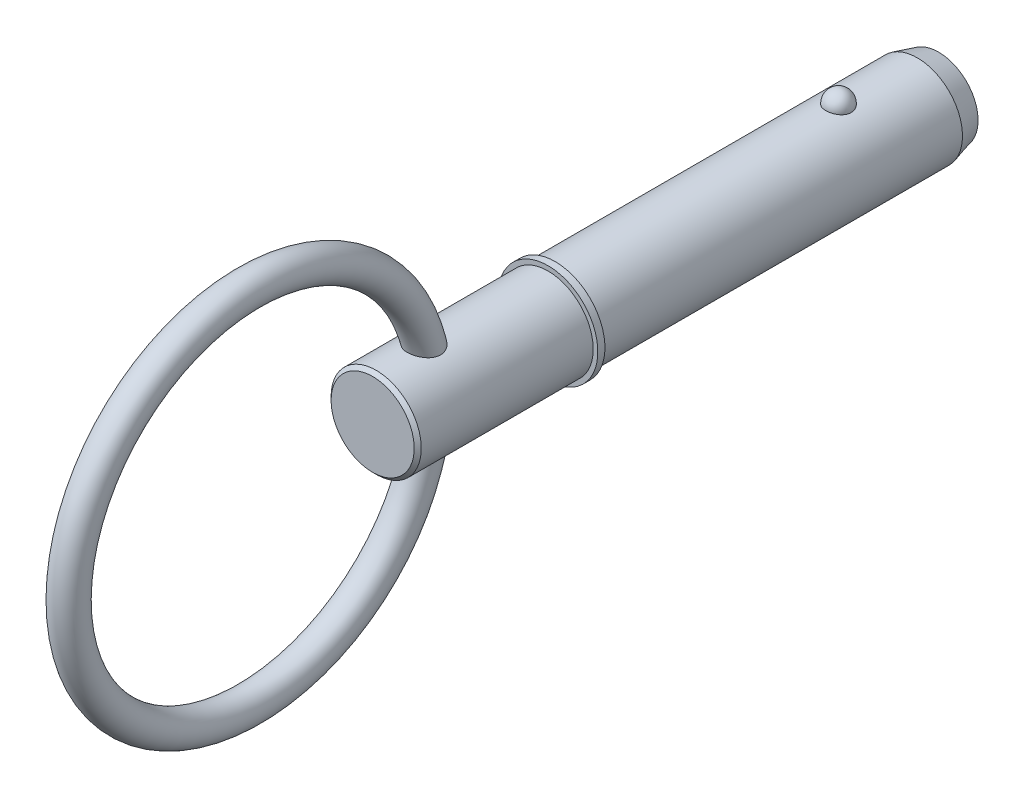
ISO-10303-21;
HEADER;
FILE_DESCRIPTION(('STEP AP214'),'2;1');
FILE_NAME('part.step','',(''),(''),'','','');
FILE_SCHEMA(('AUTOMOTIVE_DESIGN { 1 0 10303 214 1 1 1 1 }'));
ENDSEC;
DATA;
#1=APPLICATION_CONTEXT('core data for automotive mechanical design processes');
#2=APPLICATION_PROTOCOL_DEFINITION('international standard','automotive_design',2000,#1);
#3=PRODUCT_CONTEXT('',#1,'mechanical');
#4=PRODUCT('Part','Part','',(#3));
#5=PRODUCT_RELATED_PRODUCT_CATEGORY('part','',(#4));
#6=PRODUCT_DEFINITION_FORMATION('','',#4);
#7=PRODUCT_DEFINITION_CONTEXT('part definition',#1,'design');
#8=PRODUCT_DEFINITION('design','',#6,#7);
#9=PRODUCT_DEFINITION_SHAPE('','',#8);
#10=(LENGTH_UNIT() NAMED_UNIT(*) SI_UNIT(.MILLI.,.METRE.));
#11=(NAMED_UNIT(*) PLANE_ANGLE_UNIT() SI_UNIT($,.RADIAN.));
#12=(NAMED_UNIT(*) SI_UNIT($,.STERADIAN.) SOLID_ANGLE_UNIT());
#13=UNCERTAINTY_MEASURE_WITH_UNIT(LENGTH_MEASURE(1.E-05),#10,'distance_accuracy_value','');
#14=(GEOMETRIC_REPRESENTATION_CONTEXT(3) GLOBAL_UNCERTAINTY_ASSIGNED_CONTEXT((#13)) GLOBAL_UNIT_ASSIGNED_CONTEXT((#10,
#11,#12)) REPRESENTATION_CONTEXT('',''));
#15=CARTESIAN_POINT('',(0.,0.,0.));
#16=DIRECTION('',(0.,0.,1.));
#17=DIRECTION('',(1.,0.,0.));
#18=AXIS2_PLACEMENT_3D('',#15,#16,#17);
#19=CARTESIAN_POINT('',(0.,0.,38.1));
#20=DIRECTION('',(0.,0.,-1.));
#21=DIRECTION('',(-1.,0.,0.));
#22=AXIS2_PLACEMENT_3D('',#19,#20,#21);
#23=CYLINDRICAL_SURFACE('',#22,6.35);
#24=CARTESIAN_POINT('',(1.76243001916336,6.10051968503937,-1.78));
#25=CARTESIAN_POINT('',(1.76242835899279,6.10052111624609,-1.68050311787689));
#26=CARTESIAN_POINT('',(1.75431593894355,6.1028816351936,-1.58098521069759));
#27=CARTESIAN_POINT('',(1.72206027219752,6.11206037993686,-1.38476972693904));
#28=CARTESIAN_POINT('',(1.69791106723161,6.11888026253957,-1.28807321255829));
#29=CARTESIAN_POINT('',(1.63419596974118,6.13620287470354,-1.10029899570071));
#30=CARTESIAN_POINT('',(1.59463684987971,6.14670398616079,-1.00921884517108));
#31=CARTESIAN_POINT('',(1.50108569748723,6.17021534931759,-0.835161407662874));
#32=CARTESIAN_POINT('',(1.44709398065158,6.18322554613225,-0.752183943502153));
#33=CARTESIAN_POINT('',(1.3257243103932,6.21038081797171,-0.596209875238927));
#34=CARTESIAN_POINT('',(1.2582815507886,6.22453118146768,-0.523264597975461));
#35=CARTESIAN_POINT('',(1.11191624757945,6.25233390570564,-0.389855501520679));
#36=CARTESIAN_POINT('',(1.03299369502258,6.26598626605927,-0.329391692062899));
#37=CARTESIAN_POINT('',(0.866022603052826,6.29123226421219,-0.222793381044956));
#38=CARTESIAN_POINT('',(0.77800091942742,6.30283170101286,-0.176618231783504));
#39=CARTESIAN_POINT('',(0.595108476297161,6.32272058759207,-0.0996905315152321));
#40=CARTESIAN_POINT('',(0.500238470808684,6.33101040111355,-0.0689362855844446));
#41=CARTESIAN_POINT('',(0.308164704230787,6.34323464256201,-0.0241595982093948));
#42=CARTESIAN_POINT('',(0.211033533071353,6.34724467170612,-0.00984637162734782));
#43=CARTESIAN_POINT('',(0.0156629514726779,6.3507318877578,0.00262058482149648));
#44=CARTESIAN_POINT('',(-0.0825763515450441,6.35020951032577,0.000775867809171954));
#45=CARTESIAN_POINT('',(-0.275890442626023,6.34473055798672,-0.0188727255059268));
#46=CARTESIAN_POINT('',(-0.370990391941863,6.3398374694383,-0.0364481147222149));
#47=CARTESIAN_POINT('',(-0.556805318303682,6.32622723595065,-0.0867447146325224));
#48=CARTESIAN_POINT('',(-0.64752021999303,6.31751002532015,-0.119466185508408));
#49=CARTESIAN_POINT('',(-0.82260655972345,6.29711353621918,-0.199386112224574));
#50=CARTESIAN_POINT('',(-0.906938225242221,6.28541739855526,-0.246667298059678));
#51=CARTESIAN_POINT('',(-1.06646479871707,6.26032612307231,-0.35436574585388));
#52=CARTESIAN_POINT('',(-1.14165877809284,6.24693081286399,-0.414784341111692));
#53=CARTESIAN_POINT('',(-1.2823514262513,6.21959142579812,-0.548435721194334));
#54=CARTESIAN_POINT('',(-1.34763761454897,6.2056417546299,-0.621891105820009));
#55=CARTESIAN_POINT('',(-1.4651153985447,6.1789624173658,-0.778815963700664));
#56=CARTESIAN_POINT('',(-1.51730606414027,6.16623283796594,-0.862286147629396));
#57=CARTESIAN_POINT('',(-1.60782211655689,6.14325839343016,-1.0379915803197));
#58=CARTESIAN_POINT('',(-1.64598111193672,6.13304379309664,-1.13031660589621));
#59=CARTESIAN_POINT('',(-1.70661885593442,6.11644899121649,-1.32030667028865));
#60=CARTESIAN_POINT('',(-1.72909805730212,6.11006867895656,-1.41797155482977));
#61=CARTESIAN_POINT('',(-1.75775019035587,6.1018881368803,-1.61543246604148));
#62=CARTESIAN_POINT('',(-1.76399136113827,6.10006874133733,-1.71521779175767));
#63=CARTESIAN_POINT('',(-1.76020715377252,6.10116172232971,-1.91445126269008));
#64=CARTESIAN_POINT('',(-1.75018221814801,6.10407397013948,-2.01389941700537));
#65=CARTESIAN_POINT('',(-1.71421005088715,6.11427232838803,-2.20912106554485));
#66=CARTESIAN_POINT('',(-1.68834262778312,6.12153651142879,-2.30491043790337));
#67=CARTESIAN_POINT('',(-1.62139543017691,6.1396067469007,-2.49066180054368));
#68=CARTESIAN_POINT('',(-1.5803150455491,6.15041294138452,-2.58062355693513));
#69=CARTESIAN_POINT('',(-1.48369112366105,6.17443456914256,-2.75271428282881));
#70=CARTESIAN_POINT('',(-1.42806998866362,6.18766281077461,-2.83479789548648));
#71=CARTESIAN_POINT('',(-1.30386620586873,6.21501934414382,-2.98832532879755));
#72=CARTESIAN_POINT('',(-1.23528306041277,6.22914767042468,-3.05976874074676));
#73=CARTESIAN_POINT('',(-1.08663999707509,6.25679135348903,-3.19029656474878));
#74=CARTESIAN_POINT('',(-1.00653826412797,6.27030422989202,-3.24933392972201));
#75=CARTESIAN_POINT('',(-0.837212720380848,6.29514770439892,-3.35304657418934));
#76=CARTESIAN_POINT('',(-0.747989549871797,6.30647845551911,-3.39772286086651));
#77=CARTESIAN_POINT('',(-0.564098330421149,6.32556124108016,-3.47096393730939));
#78=CARTESIAN_POINT('',(-0.469512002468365,6.33335611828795,-3.49972259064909));
#79=CARTESIAN_POINT('',(-0.276633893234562,6.34470628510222,-3.54113722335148));
#80=CARTESIAN_POINT('',(-0.178342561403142,6.34826208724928,-3.55379514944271));
#81=CARTESIAN_POINT('',(0.0171660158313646,6.35071525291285,-3.56255473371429));
#82=CARTESIAN_POINT('',(0.114368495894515,6.34969931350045,-3.55896450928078));
#83=CARTESIAN_POINT('',(0.306746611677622,6.34331695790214,-3.53603383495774));
#84=CARTESIAN_POINT('',(0.401922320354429,6.33795069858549,-3.51669395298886));
#85=CARTESIAN_POINT('',(0.58720370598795,6.32347219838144,-3.4629173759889));
#86=CARTESIAN_POINT('',(0.677327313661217,6.31437430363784,-3.42853846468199));
#87=CARTESIAN_POINT('',(0.850462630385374,6.29339543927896,-3.34564128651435));
#88=CARTESIAN_POINT('',(0.933473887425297,6.2815142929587,-3.29712212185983));
#89=CARTESIAN_POINT('',(1.09144542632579,6.25601750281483,-3.18638742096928));
#90=CARTESIAN_POINT('',(1.16626195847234,6.24237795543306,-3.12397237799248));
#91=CARTESIAN_POINT('',(1.30444862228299,6.21497285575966,-2.98755865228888));
#92=CARTESIAN_POINT('',(1.36781676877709,6.20120728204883,-2.91355796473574));
#93=CARTESIAN_POINT('',(1.48252779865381,6.17479923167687,-2.75456133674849));
#94=CARTESIAN_POINT('',(1.53364167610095,6.16218052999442,-2.66939613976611));
#95=CARTESIAN_POINT('',(1.62109397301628,6.13975602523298,-2.49147502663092));
#96=CARTESIAN_POINT('',(1.657437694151,6.12994921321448,-2.39872184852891));
#97=CARTESIAN_POINT('',(1.71127844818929,6.11512175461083,-2.21887622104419));
#98=CARTESIAN_POINT('',(1.73042646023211,6.10968903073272,-2.13230770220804));
#99=CARTESIAN_POINT('',(1.75600284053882,6.10238739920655,-1.95716498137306));
#100=CARTESIAN_POINT('',(1.76243149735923,6.10051841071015,-1.86859082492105));
#101=CARTESIAN_POINT('',(1.76243001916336,6.10051968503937,-1.78));
#102=B_SPLINE_CURVE_WITH_KNOTS('',3,(#24,#25,#26,#27,#28,#29,#30,#31,#32,#33,#34,#35,#36,#37,
#38,#39,#40,#41,#42,#43,#44,#45,#46,#47,#48,#49,#50,#51,#52,#53,#54,#55,#56,#57,#58,#59,#60,#61,
#62,#63,#64,#65,#66,#67,#68,#69,#70,#71,#72,#73,#74,#75,#76,#77,#78,#79,#80,#81,#82,#83,#84,#85,
#86,#87,#88,#89,#90,#91,#92,#93,#94,#95,#96,#97,#98,#99,#100,#101),.UNSPECIFIED.,.T.,.F.,(4,2,2,
2,2,2,2,2,2,2,2,2,2,2,2,2,2,2,2,2,2,2,2,2,2,2,2,2,2,2,2,2,2,2,2,2,2,2,4),(0.,0.298172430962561,
0.596455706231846,0.894608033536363,1.19275383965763,1.49237238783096,1.79199116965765,
2.09074960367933,2.38947519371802,2.68283180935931,2.97616022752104,3.26529599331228,
3.55443672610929,3.84525169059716,4.13609618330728,4.43249276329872,4.72891038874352,
5.02873757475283,5.32855610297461,5.62711261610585,5.92566100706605,6.22271765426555,
6.51978621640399,6.81847366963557,7.11717259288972,7.41698459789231,7.71677557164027,
8.01283014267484,8.30884891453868,8.59927798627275,8.88969658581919,9.17900899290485,
9.46833977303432,9.76212836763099,10.0559678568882,10.3549321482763,10.6537890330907,
10.9192841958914,11.1847733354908),.UNSPECIFIED.);
#103=CARTESIAN_POINT('',(1.76243001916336,6.10051968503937,-1.78));
#104=VERTEX_POINT('',#103);
#105=EDGE_CURVE('E101',#104,#104,#102,.T.);
#106=ORIENTED_EDGE('',*,*,#105,.T.);
#107=EDGE_LOOP('',(#106));
#108=FACE_BOUND('',#107,.T.);
#109=CARTESIAN_POINT('',(0.,0.,-12.8800000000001));
#110=DIRECTION('',(0.,0.,-1.));
#111=DIRECTION('',(-1.,0.,0.));
#112=AXIS2_PLACEMENT_3D('',#109,#110,#111);
#113=CIRCLE('',#112,6.35);
#114=CARTESIAN_POINT('',(-6.35,0.,-12.8800000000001));
#115=VERTEX_POINT('',#114);
#116=EDGE_CURVE('E108',#115,#115,#113,.F.);
#117=ORIENTED_EDGE('',*,*,#116,.T.);
#118=EDGE_LOOP('',(#117));
#119=FACE_BOUND('',#118,.T.);
#120=CARTESIAN_POINT('',(0.,0.,38.1));
#121=DIRECTION('',(0.,0.,1.));
#122=DIRECTION('',(1.,0.,0.));
#123=AXIS2_PLACEMENT_3D('',#120,#121,#122);
#124=CIRCLE('',#123,6.35);
#125=CARTESIAN_POINT('',(6.35,0.,38.1));
#126=VERTEX_POINT('',#125);
#127=EDGE_CURVE('E106',#126,#126,#124,.T.);
#128=ORIENTED_EDGE('',*,*,#127,.F.);
#129=EDGE_LOOP('',(#128));
#130=FACE_BOUND('',#129,.T.);
#131=ADVANCED_FACE('F39',(#108,#119,#130),#23,.T.);
#132=CARTESIAN_POINT('',(0.,0.,-15.88));
#133=DIRECTION('',(0.,0.,-1.));
#134=DIRECTION('',(-1.,0.,0.));
#135=AXIS2_PLACEMENT_3D('',#132,#133,#134);
#136=PLANE('',#135);
#137=CARTESIAN_POINT('',(0.,0.,-15.88));
#138=DIRECTION('',(0.,0.,-1.));
#139=DIRECTION('',(-1.,0.,0.));
#140=AXIS2_PLACEMENT_3D('',#137,#138,#139);
#141=CIRCLE('',#140,5.54615242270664);
#142=CARTESIAN_POINT('',(-5.54615242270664,0.,-15.88));
#143=VERTEX_POINT('',#142);
#144=EDGE_CURVE('E142',#143,#143,#141,.T.);
#145=ORIENTED_EDGE('',*,*,#144,.T.);
#146=EDGE_LOOP('',(#145));
#147=FACE_BOUND('',#146,.T.);
#148=ADVANCED_FACE('F87',(#147),#136,.T.);
#149=CARTESIAN_POINT('',(0.,0.,-15.88));
#150=DIRECTION('',(0.,0.,1.));
#151=DIRECTION('',(1.,0.,0.));
#152=AXIS2_PLACEMENT_3D('',#149,#150,#151);
#153=CONICAL_SURFACE('',#152,5.54615242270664,0.26179938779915);
#154=ORIENTED_EDGE('',*,*,#116,.F.);
#155=EDGE_LOOP('',(#154));
#156=FACE_BOUND('',#155,.T.);
#157=ORIENTED_EDGE('',*,*,#144,.F.);
#158=EDGE_LOOP('',(#157));
#159=FACE_BOUND('',#158,.T.);
#160=ADVANCED_FACE('F93',(#156,#159),#153,.T.);
#161=CARTESIAN_POINT('',(0.,6.35,-1.78));
#162=DIRECTION('',(0.,1.,0.));
#163=DIRECTION('',(0.,0.,1.));
#164=AXIS2_PLACEMENT_3D('',#161,#162,#163);
#165=SPHERICAL_SURFACE('',#164,1.78);
#166=ORIENTED_EDGE('',*,*,#105,.F.);
#167=EDGE_LOOP('',(#166));
#168=FACE_BOUND('',#167,.T.);
#169=ADVANCED_FACE('F111',(#168),#165,.T.);
#170=CARTESIAN_POINT('',(0.,0.,38.1));
#171=DIRECTION('',(0.,0.,-1.));
#172=DIRECTION('',(-1.,0.,0.));
#173=AXIS2_PLACEMENT_3D('',#170,#171,#172);
#174=PLANE('',#173);
#175=ORIENTED_EDGE('',*,*,#127,.T.);
#176=EDGE_LOOP('',(#175));
#177=FACE_BOUND('',#176,.T.);
#178=CARTESIAN_POINT('',(0.,0.,38.1));
#179=DIRECTION('',(0.,0.,-1.));
#180=DIRECTION('',(-1.,0.,0.));
#181=AXIS2_PLACEMENT_3D('',#178,#179,#180);
#182=CIRCLE('',#181,7.);
#183=CARTESIAN_POINT('',(-7.,0.,38.1));
#184=VERTEX_POINT('',#183);
#185=EDGE_CURVE('E107',#184,#184,#182,.T.);
#186=ORIENTED_EDGE('',*,*,#185,.T.);
#187=EDGE_LOOP('',(#186));
#188=FACE_BOUND('',#187,.T.);
#189=ADVANCED_FACE('F115',(#177,#188),#174,.T.);
#190=CARTESIAN_POINT('',(0.,0.,33.7287874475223));
#191=DIRECTION('',(0.,0.,-1.));
#192=DIRECTION('',(-1.,0.,0.));
#193=AXIS2_PLACEMENT_3D('',#190,#191,#192);
#194=CYLINDRICAL_SURFACE('',#193,7.);
#195=CARTESIAN_POINT('',(0.,0.,39.1));
#196=DIRECTION('',(0.,0.,-1.));
#197=DIRECTION('',(-1.,0.,0.));
#198=AXIS2_PLACEMENT_3D('',#195,#196,#197);
#199=CIRCLE('',#198,7.);
#200=CARTESIAN_POINT('',(-7.,0.,39.1));
#201=VERTEX_POINT('',#200);
#202=EDGE_CURVE('E132',#201,#201,#199,.T.);
#203=ORIENTED_EDGE('',*,*,#202,.T.);
#204=EDGE_LOOP('',(#203));
#205=FACE_BOUND('',#204,.T.);
#206=ORIENTED_EDGE('',*,*,#185,.F.);
#207=EDGE_LOOP('',(#206));
#208=FACE_BOUND('',#207,.T.);
#209=ADVANCED_FACE('F119',(#205,#208),#194,.T.);
#210=CARTESIAN_POINT('',(0.,7.,39.1));
#211=DIRECTION('',(0.,0.,1.));
#212=DIRECTION('',(1.,0.,0.));
#213=AXIS2_PLACEMENT_3D('',#210,#211,#212);
#214=PLANE('',#213);
#215=CARTESIAN_POINT('',(0.,0.,39.1));
#216=DIRECTION('',(0.,0.,1.));
#217=DIRECTION('',(1.,0.,0.));
#218=AXIS2_PLACEMENT_3D('',#215,#216,#217);
#219=CIRCLE('',#218,6.35);
#220=CARTESIAN_POINT('',(6.35,0.,39.1));
#221=VERTEX_POINT('',#220);
#222=EDGE_CURVE('E110',#221,#221,#219,.T.);
#223=ORIENTED_EDGE('',*,*,#222,.F.);
#224=EDGE_LOOP('',(#223));
#225=FACE_BOUND('',#224,.T.);
#226=ORIENTED_EDGE('',*,*,#202,.F.);
#227=EDGE_LOOP('',(#226));
#228=FACE_BOUND('',#227,.T.);
#229=ADVANCED_FACE('F84',(#225,#228),#214,.T.);
#230=CARTESIAN_POINT('',(0.,0.,63.8));
#231=DIRECTION('',(0.,0.,-1.));
#232=DIRECTION('',(-1.,0.,0.));
#233=AXIS2_PLACEMENT_3D('',#230,#231,#232);
#234=CYLINDRICAL_SURFACE('',#233,6.35);
#235=CARTESIAN_POINT('',(-1.08120660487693,-6.25727514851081,54.5515811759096));
#236=CARTESIAN_POINT('',(-0.97072437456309,-6.27636409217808,54.4938798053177));
#237=CARTESIAN_POINT('',(-0.855136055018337,-6.29329984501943,54.4452195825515));
#238=CARTESIAN_POINT('',(-0.616958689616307,-6.32109419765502,54.3670559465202));
#239=CARTESIAN_POINT('',(-0.494369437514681,-6.3319526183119,54.3375530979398));
#240=CARTESIAN_POINT('',(-0.245606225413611,-6.34647141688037,54.2983673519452));
#241=CARTESIAN_POINT('',(-0.119431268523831,-6.35012977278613,54.2886900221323));
#242=CARTESIAN_POINT('',(0.132849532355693,-6.34986313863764,54.2894002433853));
#243=CARTESIAN_POINT('',(0.2589553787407,-6.34593843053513,54.2997870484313));
#244=CARTESIAN_POINT('',(0.506912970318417,-6.33094785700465,54.3402854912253));
#245=CARTESIAN_POINT('',(0.628781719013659,-6.31991516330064,54.3703055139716));
#246=CARTESIAN_POINT('',(0.865486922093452,-6.29187143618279,54.4493088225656));
#247=CARTESIAN_POINT('',(0.980322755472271,-6.27485987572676,54.498293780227));
#248=CARTESIAN_POINT('',(1.20050616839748,-6.23649440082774,54.6145408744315));
#249=CARTESIAN_POINT('',(1.30578867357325,-6.21511352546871,54.6819174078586));
#250=CARTESIAN_POINT('',(1.50311440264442,-6.17036440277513,54.8333596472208));
#251=CARTESIAN_POINT('',(1.59515714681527,-6.14699608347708,54.9174259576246));
#252=CARTESIAN_POINT('',(1.76326863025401,-6.10090072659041,55.1002474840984));
#253=CARTESIAN_POINT('',(1.83935482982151,-6.07817301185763,55.1989864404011));
#254=CARTESIAN_POINT('',(1.97338559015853,-6.03599268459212,55.408703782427));
#255=CARTESIAN_POINT('',(2.03133638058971,-6.01653894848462,55.5196779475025));
#256=CARTESIAN_POINT('',(2.1259120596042,-5.98376466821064,55.747018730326));
#257=CARTESIAN_POINT('',(2.16315310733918,-5.97026970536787,55.8631040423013));
#258=CARTESIAN_POINT('',(2.21830650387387,-5.94999923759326,56.1003187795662));
#259=CARTESIAN_POINT('',(2.2362211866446,-5.94322292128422,56.2214475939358));
#260=CARTESIAN_POINT('',(2.25273772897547,-5.93698111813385,56.4632812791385));
#261=CARTESIAN_POINT('',(2.25163224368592,-5.93740484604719,56.5839640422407));
#262=CARTESIAN_POINT('',(2.23167546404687,-5.94493297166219,56.8236203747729));
#263=CARTESIAN_POINT('',(2.21281883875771,-5.9520393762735,56.9425934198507));
#264=CARTESIAN_POINT('',(2.15679576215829,-5.97257680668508,57.183836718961));
#265=CARTESIAN_POINT('',(2.11851138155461,-5.98639144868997,57.3058128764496));
#266=CARTESIAN_POINT('',(2.02470263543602,-6.01876484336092,57.5422848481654));
#267=CARTESIAN_POINT('',(1.96916879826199,-6.03732620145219,57.6567765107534));
#268=CARTESIAN_POINT('',(1.8352662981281,-6.07945247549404,57.8879958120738));
#269=CARTESIAN_POINT('',(1.75507038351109,-6.10334207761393,58.0036110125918));
#270=CARTESIAN_POINT('',(1.57657889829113,-6.1518655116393,58.2198949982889));
#271=CARTESIAN_POINT('',(1.47827192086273,-6.17649980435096,58.3205542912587));
#272=CARTESIAN_POINT('',(1.26306696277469,-6.22410762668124,58.5050235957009));
#273=CARTESIAN_POINT('',(1.14585214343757,-6.24704086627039,58.5884783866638));
#274=CARTESIAN_POINT('',(0.896825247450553,-6.28760987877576,58.731400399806));
#275=CARTESIAN_POINT('',(0.765036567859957,-6.30525397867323,58.7909053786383));
#276=CARTESIAN_POINT('',(0.509454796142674,-6.330648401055,58.8752631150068));
#277=CARTESIAN_POINT('',(0.38696423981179,-6.33940909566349,58.9036959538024));
#278=CARTESIAN_POINT('',(0.200813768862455,-6.3471308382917,58.9286800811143));
#279=CARTESIAN_POINT('',(0.138353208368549,-6.34880140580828,58.934063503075));
#280=CARTESIAN_POINT('',(0.0131841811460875,-6.35029448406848,58.9388738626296));
#281=CARTESIAN_POINT('',(-0.049524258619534,-6.35011719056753,58.9383014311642));
#282=CARTESIAN_POINT('',(-0.219860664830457,-6.34710452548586,58.9285979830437));
#283=CARTESIAN_POINT('',(-0.32717637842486,-6.34243953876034,58.9135767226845));
#284=CARTESIAN_POINT('',(-0.537619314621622,-6.32808248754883,58.866673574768));
#285=CARTESIAN_POINT('',(-0.640746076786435,-6.31838987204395,58.8347898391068));
#286=CARTESIAN_POINT('',(-0.84179516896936,-6.29478075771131,58.7553379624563));
#287=CARTESIAN_POINT('',(-0.939631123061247,-6.28081033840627,58.70756888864));
#288=CARTESIAN_POINT('',(-1.1269056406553,-6.2499288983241,58.5985138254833));
#289=CARTESIAN_POINT('',(-1.21634109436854,-6.23301679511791,58.537222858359));
#290=CARTESIAN_POINT('',(-1.3971303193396,-6.19517308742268,58.3940397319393));
#291=CARTESIAN_POINT('',(-1.48711596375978,-6.17400700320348,58.3104839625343));
#292=CARTESIAN_POINT('',(-1.65373642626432,-6.13148145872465,58.130996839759));
#293=CARTESIAN_POINT('',(-1.73036130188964,-6.11012186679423,58.0350563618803));
#294=CARTESIAN_POINT('',(-1.87908981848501,-6.06616529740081,57.8186208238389));
#295=CARTESIAN_POINT('',(-1.94902044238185,-6.04382072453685,57.6965721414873));
#296=CARTESIAN_POINT('',(-2.06849605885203,-6.00398244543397,57.4420700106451));
#297=CARTESIAN_POINT('',(-2.11803457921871,-5.98649027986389,57.3096132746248));
#298=CARTESIAN_POINT('',(-2.19551930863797,-5.95851933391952,57.0345936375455));
#299=CARTESIAN_POINT('',(-2.22297667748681,-5.94819998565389,56.8918743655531));
#300=CARTESIAN_POINT('',(-2.25222139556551,-5.93719450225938,56.6034800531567));
#301=CARTESIAN_POINT('',(-2.25403508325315,-5.93649848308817,56.4578081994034));
#302=CARTESIAN_POINT('',(-2.23178480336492,-5.94489150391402,56.1838044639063));
#303=CARTESIAN_POINT('',(-2.21035650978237,-5.95298402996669,56.0552268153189));
#304=CARTESIAN_POINT('',(-2.14565882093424,-5.97660650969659,55.8044089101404));
#305=CARTESIAN_POINT('',(-2.10239634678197,-5.99213410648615,55.6821666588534));
#306=CARTESIAN_POINT('',(-1.99913159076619,-6.02732890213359,55.4567478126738));
#307=CARTESIAN_POINT('',(-1.94060271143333,-6.04660536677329,55.3528298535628));
#308=CARTESIAN_POINT('',(-1.80736340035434,-6.08775699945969,55.156534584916));
#309=CARTESIAN_POINT('',(-1.73265259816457,-6.10963222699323,55.0641575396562));
#310=CARTESIAN_POINT('',(-1.56865095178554,-6.15378470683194,54.8926034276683));
#311=CARTESIAN_POINT('',(-1.47928749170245,-6.17606344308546,54.8134962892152));
#312=CARTESIAN_POINT('',(-1.28858731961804,-6.21864788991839,54.6706753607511));
#313=CARTESIAN_POINT('',(-1.18724893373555,-6.23895332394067,54.6069637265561));
#314=CARTESIAN_POINT('',(-1.08120660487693,-6.25727514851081,54.5515811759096));
#315=B_SPLINE_CURVE_WITH_KNOTS('',3,(#235,#236,#237,#238,#239,#240,#241,#242,#243,#244,#245,
#246,#247,#248,#249,#250,#251,#252,#253,#254,#255,#256,#257,#258,#259,#260,#261,#262,#263,#264,
#265,#266,#267,#268,#269,#270,#271,#272,#273,#274,#275,#276,#277,#278,#279,#280,#281,#282,#283,
#284,#285,#286,#287,#288,#289,#290,#291,#292,#293,#294,#295,#296,#297,#298,#299,#300,#301,#302,
#303,#304,#305,#306,#307,#308,#309,#310,#311,#312,#313,#314),.UNSPECIFIED.,.T.,.F.,(4,2,2,2,2,2,
2,2,2,2,2,2,2,2,2,2,2,2,2,2,2,2,2,2,2,2,2,2,2,2,2,2,2,2,2,2,2,2,2,4),(0.,0.377861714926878,
0.755734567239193,1.13371352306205,1.51167842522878,1.88789208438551,2.26413891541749,
2.64278156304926,3.02143792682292,3.39967776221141,3.77778752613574,4.14394628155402,
4.51006081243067,4.87054720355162,5.23114188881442,5.61534494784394,5.99975934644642,
6.42600522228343,6.85252048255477,7.28711365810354,7.72101899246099,8.09666132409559,
8.28452949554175,8.47237776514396,8.79607953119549,9.11981678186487,9.44781545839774,
9.77593508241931,10.1483085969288,10.5209580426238,10.9463240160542,11.3718248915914,
11.8065046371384,12.2407378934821,12.6304236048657,13.0199858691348,13.3807583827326,
13.7415391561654,14.104165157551,14.4668419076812),.UNSPECIFIED.);
#316=CARTESIAN_POINT('',(-1.08120660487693,-6.25727514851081,54.5515811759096));
#317=VERTEX_POINT('',#316);
#318=EDGE_CURVE('E10',#317,#317,#315,.T.);
#319=ORIENTED_EDGE('',*,*,#318,.F.);
#320=EDGE_LOOP('',(#319));
#321=FACE_BOUND('',#320,.T.);
#322=CARTESIAN_POINT('',(-1.08120660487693,6.25727514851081,54.5515811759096));
#323=CARTESIAN_POINT('',(-1.1909316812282,6.23831652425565,54.608887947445));
#324=CARTESIAN_POINT('',(-1.295627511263,6.21723224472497,54.6751167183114));
#325=CARTESIAN_POINT('',(-1.49211272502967,6.17302620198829,54.824020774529));
#326=CARTESIAN_POINT('',(-1.58390200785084,6.14990442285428,54.9066961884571));
#327=CARTESIAN_POINT('',(-1.7520969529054,6.10411985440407,55.0867778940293));
#328=CARTESIAN_POINT('',(-1.82848346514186,6.08145766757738,55.1842022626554));
#329=CARTESIAN_POINT('',(-1.96346259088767,6.0392331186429,55.3912733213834));
#330=CARTESIAN_POINT('',(-2.02206050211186,6.01966983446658,55.5009163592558));
#331=CARTESIAN_POINT('',(-2.11860444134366,5.9863659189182,55.7265649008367));
#332=CARTESIAN_POINT('',(-2.15701637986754,5.97249571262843,55.8423519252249));
#333=CARTESIAN_POINT('',(-2.2144930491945,5.95142584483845,56.0791911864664));
#334=CARTESIAN_POINT('',(-2.23356015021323,5.94422536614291,56.2002427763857));
#335=CARTESIAN_POINT('',(-2.25228141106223,5.93715610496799,56.4419445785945));
#336=CARTESIAN_POINT('',(-2.25225786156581,5.93716560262,56.5625670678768));
#337=CARTESIAN_POINT('',(-2.2344206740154,5.94389982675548,56.8022777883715));
#338=CARTESIAN_POINT('',(-2.21660184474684,5.95062651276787,56.9213655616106));
#339=CARTESIAN_POINT('',(-2.16272689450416,5.97042554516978,57.1627056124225));
#340=CARTESIAN_POINT('',(-2.12559286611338,5.98387086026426,57.2846848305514));
#341=CARTESIAN_POINT('',(-2.03409944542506,6.0155857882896,57.521342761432));
#342=CARTESIAN_POINT('',(-1.97973080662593,6.03385799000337,57.6360175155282));
#343=CARTESIAN_POINT('',(-1.84828023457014,6.07549301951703,57.8678654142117));
#344=CARTESIAN_POINT('',(-1.76936622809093,6.09919386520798,57.9839437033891));
#345=CARTESIAN_POINT('',(-1.59344783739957,6.14749881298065,58.2014208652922));
#346=CARTESIAN_POINT('',(-1.49643151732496,6.17210350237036,58.3028099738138));
#347=CARTESIAN_POINT('',(-1.28333318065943,6.21994692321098,58.4895083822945));
#348=CARTESIAN_POINT('',(-1.16685721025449,6.24314005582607,58.5743845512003));
#349=CARTESIAN_POINT('',(-0.919062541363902,6.2843871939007,58.7203440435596));
#350=CARTESIAN_POINT('',(-0.787766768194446,6.30244898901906,58.7814634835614));
#351=CARTESIAN_POINT('',(-0.532335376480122,6.32876911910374,58.8691112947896));
#352=CARTESIAN_POINT('',(-0.409516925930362,6.33800211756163,58.8991235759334));
#353=CARTESIAN_POINT('',(-0.222636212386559,6.34640533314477,58.9263386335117));
#354=CARTESIAN_POINT('',(-0.159893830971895,6.34829860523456,58.9324428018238));
#355=CARTESIAN_POINT('',(-0.0340877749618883,6.35021985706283,58.9386341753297));
#356=CARTESIAN_POINT('',(0.0289758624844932,6.35024804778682,58.9387220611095));
#357=CARTESIAN_POINT('',(0.200008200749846,6.34776620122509,58.930732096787));
#358=CARTESIAN_POINT('',(0.307730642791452,6.34342046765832,58.9167500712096));
#359=CARTESIAN_POINT('',(0.519134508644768,6.32963338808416,58.8717653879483));
#360=CARTESIAN_POINT('',(0.622815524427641,6.3201915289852,58.8407610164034));
#361=CARTESIAN_POINT('',(0.824580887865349,6.2970603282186,58.7630869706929));
#362=CARTESIAN_POINT('',(0.922611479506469,6.28333629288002,58.7162890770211));
#363=CARTESIAN_POINT('',(1.11039970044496,6.2528858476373,58.6091226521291));
#364=CARTESIAN_POINT('',(1.20015435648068,6.23615836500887,58.5487492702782));
#365=CARTESIAN_POINT('',(1.38155818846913,6.19866747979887,58.4076024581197));
#366=CARTESIAN_POINT('',(1.4718764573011,6.17766310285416,58.3251847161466));
#367=CARTESIAN_POINT('',(1.63933626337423,6.13535258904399,58.1479469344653));
#368=CARTESIAN_POINT('',(1.71646809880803,6.11404624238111,58.0531178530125));
#369=CARTESIAN_POINT('',(1.86660460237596,6.07002946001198,57.838851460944));
#370=CARTESIAN_POINT('',(1.93743710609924,6.04755477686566,57.7178347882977));
#371=CARTESIAN_POINT('',(2.05894300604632,6.00727604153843,57.4652808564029));
#372=CARTESIAN_POINT('',(2.10960917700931,5.98947366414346,57.3337398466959));
#373=CARTESIAN_POINT('',(2.18982014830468,5.96062717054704,57.0597589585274));
#374=CARTESIAN_POINT('',(2.21877575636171,5.94977267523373,56.9171236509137));
#375=CARTESIAN_POINT('',(2.25104759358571,5.93764416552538,56.6285958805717));
#376=CARTESIAN_POINT('',(2.25438985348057,5.93636042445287,56.4827068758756));
#377=CARTESIAN_POINT('',(2.23498011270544,5.94368858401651,56.2077311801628));
#378=CARTESIAN_POINT('',(2.21482640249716,5.95131530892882,56.0784341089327));
#379=CARTESIAN_POINT('',(2.15248760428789,5.97414352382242,55.8259695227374));
#380=CARTESIAN_POINT('',(2.11031020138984,5.98934237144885,55.7027998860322));
#381=CARTESIAN_POINT('',(2.00904610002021,6.02402214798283,55.4757832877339));
#382=CARTESIAN_POINT('',(1.95150192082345,6.04308594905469,55.3711789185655));
#383=CARTESIAN_POINT('',(1.82009972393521,6.08395083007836,55.1733823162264));
#384=CARTESIAN_POINT('',(1.74624088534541,6.10575204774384,55.0801906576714));
#385=CARTESIAN_POINT('',(1.58309476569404,6.15008431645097,54.9061646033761));
#386=CARTESIAN_POINT('',(1.49360904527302,6.17262128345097,54.8255180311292));
#387=CARTESIAN_POINT('',(1.30231515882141,6.21579297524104,54.6798366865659));
#388=CARTESIAN_POINT('',(1.20050521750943,6.23642742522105,54.6148041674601));
#389=CARTESIAN_POINT('',(0.983786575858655,6.27432316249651,54.4998596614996));
#390=CARTESIAN_POINT('',(0.868563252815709,6.29145558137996,54.4504972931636));
#391=CARTESIAN_POINT('',(0.630994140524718,6.31970327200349,54.3708857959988));
#392=CARTESIAN_POINT('',(0.508648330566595,6.33081852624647,54.3406367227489));
#393=CARTESIAN_POINT('',(0.25993361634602,6.34590352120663,54.2998795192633));
#394=CARTESIAN_POINT('',(0.133554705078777,6.34985380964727,54.2894251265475));
#395=CARTESIAN_POINT('',(-0.119270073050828,6.35013815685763,54.2886676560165));
#396=CARTESIAN_POINT('',(-0.245715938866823,6.34647233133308,54.2983642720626));
#397=CARTESIAN_POINT('',(-0.494670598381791,6.33192772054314,54.3376209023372));
#398=CARTESIAN_POINT('',(-0.61718986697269,6.3210701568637,54.3671224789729));
#399=CARTESIAN_POINT('',(-0.855240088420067,6.29328476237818,54.4452630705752));
#400=CARTESIAN_POINT('',(-0.970770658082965,6.27635659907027,54.4939031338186));
#401=CARTESIAN_POINT('',(-1.08120660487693,6.25727514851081,54.5515811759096));
#402=B_SPLINE_CURVE_WITH_KNOTS('',3,(#322,#323,#324,#325,#326,#327,#328,#329,#330,#331,#332,
#333,#334,#335,#336,#337,#338,#339,#340,#341,#342,#343,#344,#345,#346,#347,#348,#349,#350,#351,
#352,#353,#354,#355,#356,#357,#358,#359,#360,#361,#362,#363,#364,#365,#366,#367,#368,#369,#370,
#371,#372,#373,#374,#375,#376,#377,#378,#379,#380,#381,#382,#383,#384,#385,#386,#387,#388,#389,
#390,#391,#392,#393,#394,#395,#396,#397,#398,#399,#400,#401),.UNSPECIFIED.,.T.,.F.,(4,2,2,2,2,2,
2,2,2,2,2,2,2,2,2,2,2,2,2,2,2,2,2,2,2,2,2,2,2,2,2,2,2,2,2,2,2,2,2,4),(0.,0.375258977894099,
0.750520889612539,1.12624651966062,1.50186014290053,1.86837438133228,2.23484370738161,
2.59512638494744,2.95551419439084,3.33859924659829,3.72189017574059,4.14704029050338,
4.5724717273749,5.00788576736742,5.44263524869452,5.82040093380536,6.00932292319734,
6.19822354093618,6.52266071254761,6.8471305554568,7.1743006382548,7.50158780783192,
7.8723327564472,8.24334931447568,8.66748794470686,9.09177840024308,9.52720369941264,
9.96218641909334,10.3532895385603,10.7442562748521,11.1052784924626,11.4663188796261,
11.8323306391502,12.1983951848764,12.5761580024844,12.9539219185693,13.3327099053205,
13.7114921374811,14.0891615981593,14.4668517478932),.UNSPECIFIED.);
#403=CARTESIAN_POINT('',(-1.08120660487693,6.25727514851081,54.5515811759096));
#404=VERTEX_POINT('',#403);
#405=EDGE_CURVE('E51',#404,#404,#402,.T.);
#406=ORIENTED_EDGE('',*,*,#405,.F.);
#407=EDGE_LOOP('',(#406));
#408=FACE_BOUND('',#407,.T.);
#409=CARTESIAN_POINT('',(0.,0.,63.3));
#410=DIRECTION('',(0.,0.,-1.));
#411=DIRECTION('',(-1.,0.,0.));
#412=AXIS2_PLACEMENT_3D('',#409,#410,#411);
#413=CIRCLE('',#412,6.35);
#414=CARTESIAN_POINT('',(-6.35,0.,63.3));
#415=VERTEX_POINT('',#414);
#416=EDGE_CURVE('E63',#415,#415,#413,.T.);
#417=ORIENTED_EDGE('',*,*,#416,.T.);
#418=EDGE_LOOP('',(#417));
#419=FACE_BOUND('',#418,.T.);
#420=ORIENTED_EDGE('',*,*,#222,.T.);
#421=EDGE_LOOP('',(#420));
#422=FACE_BOUND('',#421,.T.);
#423=ADVANCED_FACE('F68',(#321,#408,#419,#422),#234,.T.);
#424=CARTESIAN_POINT('',(0.,0.,63.8));
#425=DIRECTION('',(0.,0.,-1.));
#426=DIRECTION('',(-1.,0.,0.));
#427=AXIS2_PLACEMENT_3D('',#424,#425,#426);
#428=PLANE('',#427);
#429=CARTESIAN_POINT('',(0.,0.,63.8));
#430=DIRECTION('',(0.,0.,-1.));
#431=DIRECTION('',(-1.,0.,0.));
#432=AXIS2_PLACEMENT_3D('',#429,#430,#431);
#433=CIRCLE('',#432,5.84999999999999);
#434=CARTESIAN_POINT('',(-5.84999999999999,0.,63.8));
#435=VERTEX_POINT('',#434);
#436=EDGE_CURVE('E57',#435,#435,#433,.F.);
#437=ORIENTED_EDGE('',*,*,#436,.T.);
#438=EDGE_LOOP('',(#437));
#439=FACE_BOUND('',#438,.T.);
#440=ADVANCED_FACE('F75',(#439),#428,.F.);
#441=CARTESIAN_POINT('',(0.,0.,63.3));
#442=DIRECTION('',(0.,0.,-1.));
#443=DIRECTION('',(-1.,0.,0.));
#444=AXIS2_PLACEMENT_3D('',#441,#442,#443);
#445=CONICAL_SURFACE('',#444,6.35,0.785398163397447);
#446=ORIENTED_EDGE('',*,*,#436,.F.);
#447=EDGE_LOOP('',(#446));
#448=FACE_BOUND('',#447,.T.);
#449=ORIENTED_EDGE('',*,*,#416,.F.);
#450=EDGE_LOOP('',(#449));
#451=FACE_BOUND('',#450,.T.);
#452=ADVANCED_FACE('F41',(#448,#451),#445,.T.);
#453=CARTESIAN_POINT('',(0.,0.,81.2));
#454=DIRECTION('',(1.,0.,0.));
#455=DIRECTION('',(0.,0.,-1.));
#456=AXIS2_PLACEMENT_3D('',#453,#454,#455);
#457=TOROIDAL_SURFACE('',#456,25.4,2.25);
#458=ORIENTED_EDGE('',*,*,#318,.T.);
#459=EDGE_LOOP('',(#458));
#460=FACE_BOUND('',#459,.T.);
#461=ORIENTED_EDGE('',*,*,#405,.T.);
#462=EDGE_LOOP('',(#461));
#463=FACE_BOUND('',#462,.T.);
#464=ADVANCED_FACE('F72',(#460,#463),#457,.T.);
#465=CLOSED_SHELL('',(#131,#148,#160,#169,#189,#209,#229,#423,#440,#452,#464));
#466=MANIFOLD_SOLID_BREP('B2',#465);
#467=ADVANCED_BREP_SHAPE_REPRESENTATION('',(#18,#466),#14);
#468=SHAPE_DEFINITION_REPRESENTATION(#9,#467);
ENDSEC;
END-ISO-10303-21;
